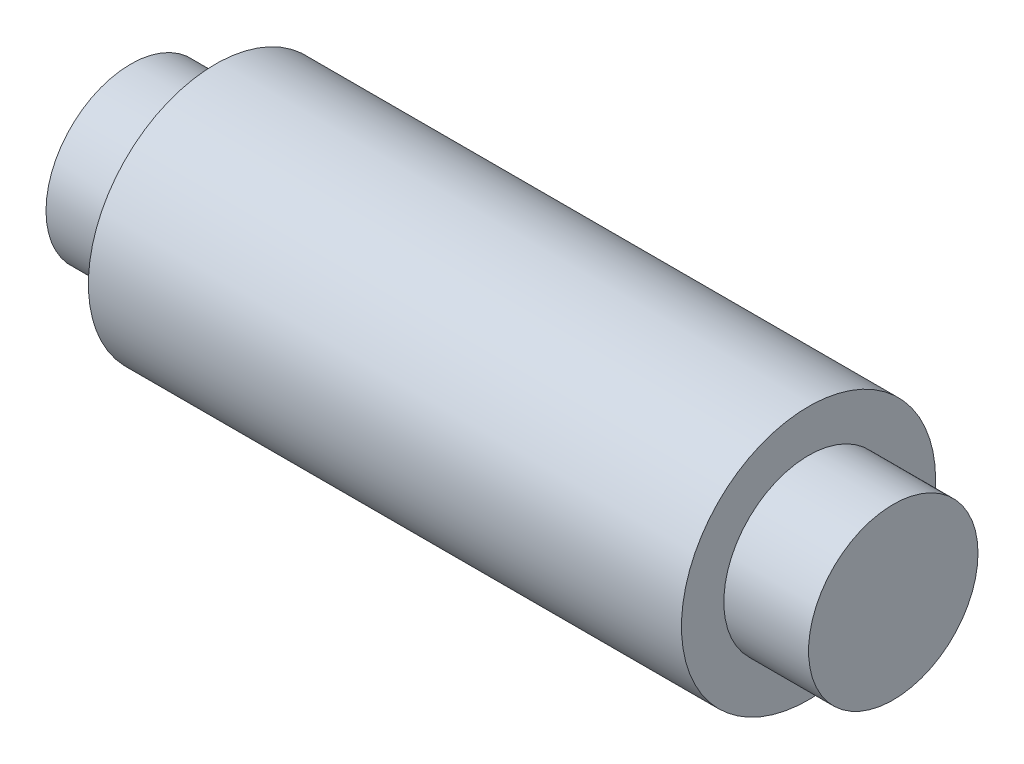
from build123d import *

# Parameters (mm, degrees)
SKETCH_ROLLING_WHEEL_R     = 15
ROLLING_WHEEL_DEPTH        = 35
SKETCH_WHEEL_SHAFT_RIGHT_R = 10
WHEEL_SHAFT_RIGHT_DEPTH    = 10
WHEEL_START                = 10
SKETCH_WHEEL_SHAFT_LEFT_R  = 10
WHEEL_SHAFT_LEFT_DEPTH     = 10


with BuildPart() as part:
    # Sketch_Rolling Wheel → Rolling Wheel (new, symmetric)
    with BuildSketch(Plane(origin=(0, 0, 0), x_dir=(0, 0, -1), z_dir=(1, 0, 0))):
        Circle(SKETCH_ROLLING_WHEEL_R)
    extrude(amount=ROLLING_WHEEL_DEPTH, both=True)

    # Sketch_Wheel Shaft_ Right → Wheel Shaft_ Right (add)
    with BuildSketch(Plane(origin=(35, 0, 0), x_dir=(0, 0, -1), z_dir=(1, 0, 0))):
        Circle(SKETCH_WHEEL_SHAFT_RIGHT_R)
    extrude(amount=WHEEL_SHAFT_RIGHT_DEPTH)

    # Sketch_Wheel Shaft_ Left → Wheel Shaft_ Left (add)
    with BuildSketch(Plane.ZY.offset(35).offset(WHEEL_START)):
        with Locations(Location((0, 0, 0), (0, 0, 180))):
            Circle(SKETCH_WHEEL_SHAFT_LEFT_R)
    extrude(amount=-WHEEL_SHAFT_LEFT_DEPTH)


solid = part.part
